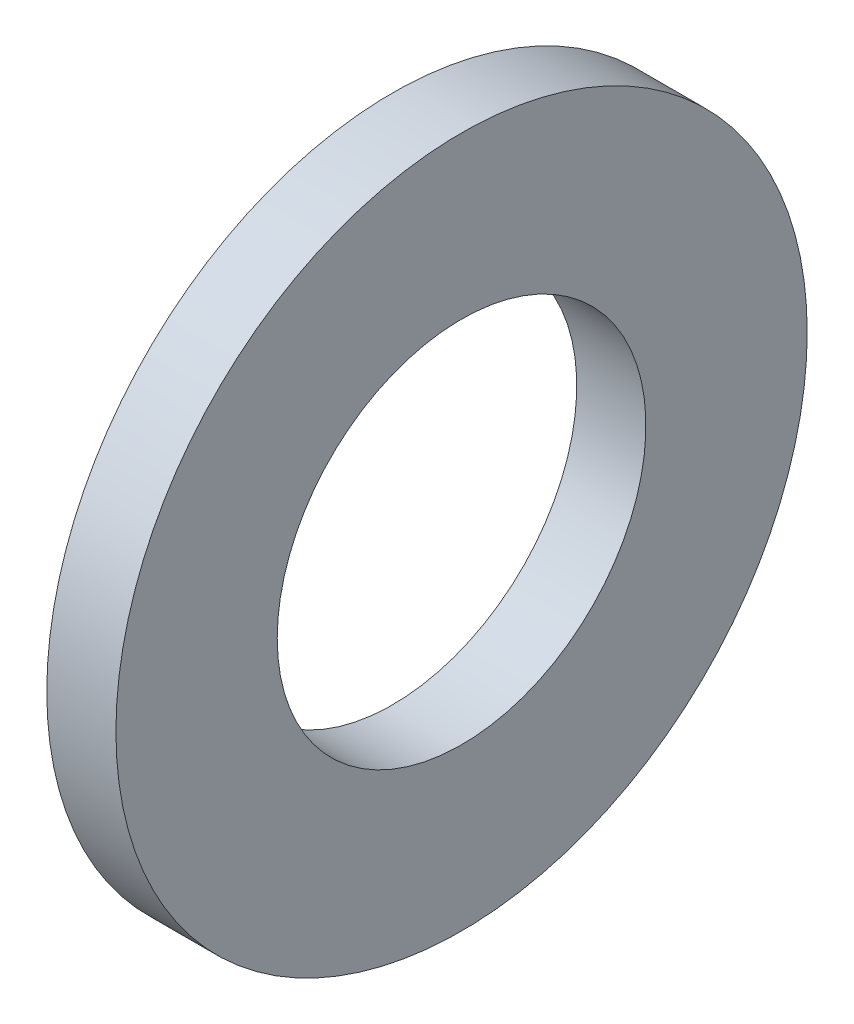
ISO-10303-21;
HEADER;
FILE_DESCRIPTION(('STEP AP214'),'2;1');
FILE_NAME('part.step','',(''),(''),'','','');
FILE_SCHEMA(('AUTOMOTIVE_DESIGN { 1 0 10303 214 1 1 1 1 }'));
ENDSEC;
DATA;
#1=APPLICATION_CONTEXT('core data for automotive mechanical design processes');
#2=APPLICATION_PROTOCOL_DEFINITION('international standard','automotive_design',2000,#1);
#3=PRODUCT_CONTEXT('',#1,'mechanical');
#4=PRODUCT('Part','Part','',(#3));
#5=PRODUCT_RELATED_PRODUCT_CATEGORY('part','',(#4));
#6=PRODUCT_DEFINITION_FORMATION('','',#4);
#7=PRODUCT_DEFINITION_CONTEXT('part definition',#1,'design');
#8=PRODUCT_DEFINITION('design','',#6,#7);
#9=PRODUCT_DEFINITION_SHAPE('','',#8);
#10=(LENGTH_UNIT() NAMED_UNIT(*) SI_UNIT(.MILLI.,.METRE.));
#11=(NAMED_UNIT(*) PLANE_ANGLE_UNIT() SI_UNIT($,.RADIAN.));
#12=(NAMED_UNIT(*) SI_UNIT($,.STERADIAN.) SOLID_ANGLE_UNIT());
#13=UNCERTAINTY_MEASURE_WITH_UNIT(LENGTH_MEASURE(1.E-05),#10,'distance_accuracy_value','');
#14=(GEOMETRIC_REPRESENTATION_CONTEXT(3) GLOBAL_UNCERTAINTY_ASSIGNED_CONTEXT((#13)) GLOBAL_UNIT_ASSIGNED_CONTEXT((#10,
#11,#12)) REPRESENTATION_CONTEXT('',''));
#15=CARTESIAN_POINT('',(0.,0.,0.));
#16=DIRECTION('',(0.,0.,1.));
#17=DIRECTION('',(1.,0.,0.));
#18=AXIS2_PLACEMENT_3D('',#15,#16,#17);
#19=CARTESIAN_POINT('',(0.,0.,-6.));
#20=DIRECTION('',(1.,0.,0.));
#21=DIRECTION('',(0.,0.,-1.));
#22=AXIS2_PLACEMENT_3D('',#19,#20,#21);
#23=PLANE('',#22);
#24=CARTESIAN_POINT('',(0.,0.,0.));
#25=DIRECTION('',(-1.,0.,0.));
#26=DIRECTION('',(0.,0.,1.));
#27=AXIS2_PLACEMENT_3D('',#24,#25,#26);
#28=CIRCLE('',#27,3.2);
#29=CARTESIAN_POINT('',(0.,0.,3.2));
#30=VERTEX_POINT('',#29);
#31=EDGE_CURVE('E10',#30,#30,#28,.T.);
#32=ORIENTED_EDGE('',*,*,#31,.F.);
#33=EDGE_LOOP('',(#32));
#34=FACE_BOUND('',#33,.T.);
#35=CARTESIAN_POINT('',(0.,0.,0.));
#36=DIRECTION('',(-1.,0.,0.));
#37=DIRECTION('',(0.,0.,1.));
#38=AXIS2_PLACEMENT_3D('',#35,#36,#37);
#39=CIRCLE('',#38,6.);
#40=CARTESIAN_POINT('',(0.,0.,6.));
#41=VERTEX_POINT('',#40);
#42=EDGE_CURVE('E45',#41,#41,#39,.T.);
#43=ORIENTED_EDGE('',*,*,#42,.T.);
#44=EDGE_LOOP('',(#43));
#45=FACE_BOUND('',#44,.T.);
#46=ADVANCED_FACE('F31',(#34,#45),#23,.F.);
#47=CARTESIAN_POINT('',(0.,0.,0.));
#48=DIRECTION('',(-1.,0.,0.));
#49=DIRECTION('',(0.,0.,1.));
#50=AXIS2_PLACEMENT_3D('',#47,#48,#49);
#51=CYLINDRICAL_SURFACE('',#50,3.2);
#52=CARTESIAN_POINT('',(1.2,0.,0.));
#53=DIRECTION('',(-1.,0.,0.));
#54=DIRECTION('',(0.,0.,1.));
#55=AXIS2_PLACEMENT_3D('',#52,#53,#54);
#56=CIRCLE('',#55,3.2);
#57=CARTESIAN_POINT('',(1.2,0.,3.2));
#58=VERTEX_POINT('',#57);
#59=EDGE_CURVE('E37',#58,#58,#56,.T.);
#60=ORIENTED_EDGE('',*,*,#59,.F.);
#61=EDGE_LOOP('',(#60));
#62=FACE_BOUND('',#61,.T.);
#63=ORIENTED_EDGE('',*,*,#31,.T.);
#64=EDGE_LOOP('',(#63));
#65=FACE_BOUND('',#64,.T.);
#66=ADVANCED_FACE('F60',(#62,#65),#51,.F.);
#67=CARTESIAN_POINT('',(1.2,0.,-6.));
#68=DIRECTION('',(-1.,0.,0.));
#69=DIRECTION('',(0.,0.,1.));
#70=AXIS2_PLACEMENT_3D('',#67,#68,#69);
#71=PLANE('',#70);
#72=CARTESIAN_POINT('',(1.2,0.,0.));
#73=DIRECTION('',(-1.,0.,0.));
#74=DIRECTION('',(0.,0.,1.));
#75=AXIS2_PLACEMENT_3D('',#72,#73,#74);
#76=CIRCLE('',#75,6.);
#77=CARTESIAN_POINT('',(1.2,0.,6.));
#78=VERTEX_POINT('',#77);
#79=EDGE_CURVE('E41',#78,#78,#76,.T.);
#80=ORIENTED_EDGE('',*,*,#79,.F.);
#81=EDGE_LOOP('',(#80));
#82=FACE_BOUND('',#81,.T.);
#83=ORIENTED_EDGE('',*,*,#59,.T.);
#84=EDGE_LOOP('',(#83));
#85=FACE_BOUND('',#84,.T.);
#86=ADVANCED_FACE('F55',(#82,#85),#71,.F.);
#87=CARTESIAN_POINT('',(0.,0.,0.));
#88=DIRECTION('',(-1.,0.,0.));
#89=DIRECTION('',(0.,0.,1.));
#90=AXIS2_PLACEMENT_3D('',#87,#88,#89);
#91=CYLINDRICAL_SURFACE('',#90,6.);
#92=ORIENTED_EDGE('',*,*,#42,.F.);
#93=EDGE_LOOP('',(#92));
#94=FACE_BOUND('',#93,.T.);
#95=ORIENTED_EDGE('',*,*,#79,.T.);
#96=EDGE_LOOP('',(#95));
#97=FACE_BOUND('',#96,.T.);
#98=ADVANCED_FACE('F52',(#94,#97),#91,.T.);
#99=CLOSED_SHELL('',(#46,#66,#86,#98));
#100=MANIFOLD_SOLID_BREP('B2',#99);
#101=ADVANCED_BREP_SHAPE_REPRESENTATION('',(#18,#100),#14);
#102=SHAPE_DEFINITION_REPRESENTATION(#9,#101);
ENDSEC;
END-ISO-10303-21;
